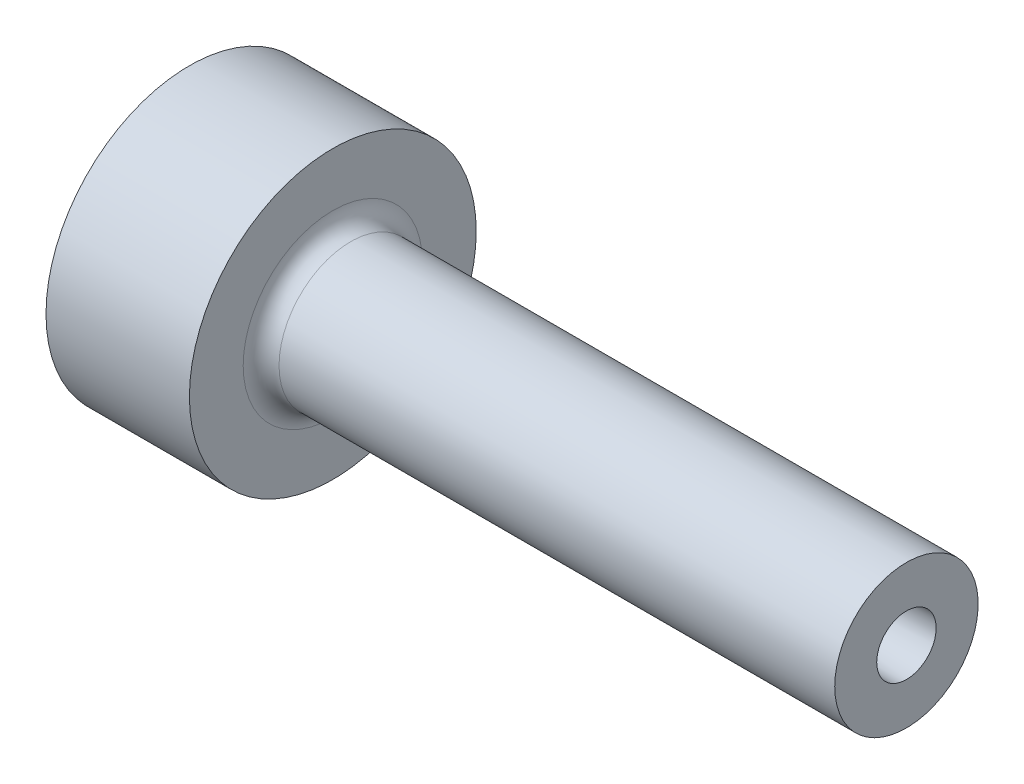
ISO-10303-21;
HEADER;
FILE_DESCRIPTION(('STEP AP214'),'2;1');
FILE_NAME('part.step','',(''),(''),'','','');
FILE_SCHEMA(('AUTOMOTIVE_DESIGN { 1 0 10303 214 1 1 1 1 }'));
ENDSEC;
DATA;
#1=APPLICATION_CONTEXT('core data for automotive mechanical design processes');
#2=APPLICATION_PROTOCOL_DEFINITION('international standard','automotive_design',2000,#1);
#3=PRODUCT_CONTEXT('',#1,'mechanical');
#4=PRODUCT('Part','Part','',(#3));
#5=PRODUCT_RELATED_PRODUCT_CATEGORY('part','',(#4));
#6=PRODUCT_DEFINITION_FORMATION('','',#4);
#7=PRODUCT_DEFINITION_CONTEXT('part definition',#1,'design');
#8=PRODUCT_DEFINITION('design','',#6,#7);
#9=PRODUCT_DEFINITION_SHAPE('','',#8);
#10=(LENGTH_UNIT() NAMED_UNIT(*) SI_UNIT(.MILLI.,.METRE.));
#11=(NAMED_UNIT(*) PLANE_ANGLE_UNIT() SI_UNIT($,.RADIAN.));
#12=(NAMED_UNIT(*) SI_UNIT($,.STERADIAN.) SOLID_ANGLE_UNIT());
#13=UNCERTAINTY_MEASURE_WITH_UNIT(LENGTH_MEASURE(1.E-05),#10,'distance_accuracy_value','');
#14=(GEOMETRIC_REPRESENTATION_CONTEXT(3) GLOBAL_UNCERTAINTY_ASSIGNED_CONTEXT((#13)) GLOBAL_UNIT_ASSIGNED_CONTEXT((#10,
#11,#12)) REPRESENTATION_CONTEXT('',''));
#15=CARTESIAN_POINT('',(0.,0.,0.));
#16=DIRECTION('',(0.,0.,1.));
#17=DIRECTION('',(1.,0.,0.));
#18=AXIS2_PLACEMENT_3D('',#15,#16,#17);
#19=CARTESIAN_POINT('',(0.,0.,0.));
#20=DIRECTION('',(-1.,0.,0.));
#21=DIRECTION('',(0.,0.,1.));
#22=AXIS2_PLACEMENT_3D('',#19,#20,#21);
#23=CYLINDRICAL_SURFACE('',#22,24.);
#24=CARTESIAN_POINT('',(24.,0.,0.));
#25=DIRECTION('',(-1.,0.,0.));
#26=DIRECTION('',(0.,0.,1.));
#27=AXIS2_PLACEMENT_3D('',#24,#25,#26);
#28=CIRCLE('',#27,24.);
#29=CARTESIAN_POINT('',(24.,0.,24.));
#30=VERTEX_POINT('',#29);
#31=EDGE_CURVE('E90',#30,#30,#28,.T.);
#32=ORIENTED_EDGE('',*,*,#31,.T.);
#33=EDGE_LOOP('',(#32));
#34=FACE_BOUND('',#33,.T.);
#35=CARTESIAN_POINT('',(0.,0.,0.));
#36=DIRECTION('',(-1.,0.,0.));
#37=DIRECTION('',(0.,0.,1.));
#38=AXIS2_PLACEMENT_3D('',#35,#36,#37);
#39=CIRCLE('',#38,24.);
#40=CARTESIAN_POINT('',(0.,0.,24.));
#41=VERTEX_POINT('',#40);
#42=EDGE_CURVE('E84',#41,#41,#39,.T.);
#43=ORIENTED_EDGE('',*,*,#42,.F.);
#44=EDGE_LOOP('',(#43));
#45=FACE_BOUND('',#44,.T.);
#46=CARTESIAN_POINT('',(12.,-23.9165214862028,-2.));
#47=CARTESIAN_POINT('',(12.1121314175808,-23.9165225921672,-1.99999510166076));
#48=CARTESIAN_POINT('',(12.2243391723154,-23.9173185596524,-1.99053818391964));
#49=CARTESIAN_POINT('',(12.4456500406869,-23.9204163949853,-1.95295195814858));
#50=CARTESIAN_POINT('',(12.5547494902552,-23.9227199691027,-1.92480149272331));
#51=CARTESIAN_POINT('',(12.7666063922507,-23.9285703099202,-1.85064796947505));
#52=CARTESIAN_POINT('',(12.8693674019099,-23.9321163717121,-1.80465503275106));
#53=CARTESIAN_POINT('',(13.0656863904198,-23.9400512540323,-1.69614013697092));
#54=CARTESIAN_POINT('',(13.1592463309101,-23.944439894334,-1.63362171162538));
#55=CARTESIAN_POINT('',(13.3347720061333,-23.9535780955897,-1.49365707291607));
#56=CARTESIAN_POINT('',(13.4167108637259,-23.9583284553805,-1.41617720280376));
#57=CARTESIAN_POINT('',(13.566437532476,-23.9676475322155,-1.24856024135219));
#58=CARTESIAN_POINT('',(13.6342247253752,-23.9722162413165,-1.15842259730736));
#59=CARTESIAN_POINT('',(13.7538132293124,-23.9806648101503,-0.967888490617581));
#60=CARTESIAN_POINT('',(13.8055912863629,-23.9845436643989,-0.867477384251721));
#61=CARTESIAN_POINT('',(13.891542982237,-23.9911668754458,-0.659348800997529));
#62=CARTESIAN_POINT('',(13.9257169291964,-23.9939112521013,-0.551631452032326));
#63=CARTESIAN_POINT('',(13.9754129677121,-23.9979507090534,-0.332215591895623));
#64=CARTESIAN_POINT('',(13.9909785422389,-23.999249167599,-0.220526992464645));
#65=CARTESIAN_POINT('',(14.0031504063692,-24.0002619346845,0.00388456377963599));
#66=CARTESIAN_POINT('',(13.9997570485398,-23.9999762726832,0.116607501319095));
#67=CARTESIAN_POINT('',(13.9741429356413,-23.9978557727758,0.339593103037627));
#68=CARTESIAN_POINT('',(13.9519689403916,-23.9960247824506,0.449861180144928));
#69=CARTESIAN_POINT('',(13.8894956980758,-23.9910239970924,0.665104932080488));
#70=CARTESIAN_POINT('',(13.8491962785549,-23.9878541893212,0.770080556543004));
#71=CARTESIAN_POINT('',(13.7515640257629,-23.9805257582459,0.971908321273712));
#72=CARTESIAN_POINT('',(13.6942102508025,-23.9763659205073,1.06875028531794));
#73=CARTESIAN_POINT('',(13.5641125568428,-23.967524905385,1.25145067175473));
#74=CARTESIAN_POINT('',(13.4913683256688,-23.9628437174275,1.33730887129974));
#75=CARTESIAN_POINT('',(13.3322911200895,-23.9534692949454,1.49587792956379));
#76=CARTESIAN_POINT('',(13.2459175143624,-23.9487760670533,1.56854803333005));
#77=CARTESIAN_POINT('',(13.0621749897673,-23.9399208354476,1.69836319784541));
#78=CARTESIAN_POINT('',(12.9648060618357,-23.9357588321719,1.75550824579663));
#79=CARTESIAN_POINT('',(12.7618082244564,-23.9284365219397,1.85264960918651));
#80=CARTESIAN_POINT('',(12.6561782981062,-23.9252763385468,1.8926438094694));
#81=CARTESIAN_POINT('',(12.439670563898,-23.9203178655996,1.95431801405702));
#82=CARTESIAN_POINT('',(12.3287928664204,-23.9185195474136,1.9759984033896));
#83=CARTESIAN_POINT('',(12.1052936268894,-23.9164930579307,2.00037796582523));
#84=CARTESIAN_POINT('',(11.9926783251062,-23.9162601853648,2.00313397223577));
#85=CARTESIAN_POINT('',(11.7685873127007,-23.9173785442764,1.98973541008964));
#86=CARTESIAN_POINT('',(11.6571115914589,-23.9187297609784,1.97358101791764));
#87=CARTESIAN_POINT('',(11.4386272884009,-23.922859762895,1.92286760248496));
#88=CARTESIAN_POINT('',(11.3316125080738,-23.9256364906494,1.8883351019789));
#89=CARTESIAN_POINT('',(11.1248958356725,-23.9323029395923,1.80187268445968));
#90=CARTESIAN_POINT('',(11.0251940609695,-23.9361926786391,1.74994248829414));
#91=CARTESIAN_POINT('',(10.8356734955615,-23.9446582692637,1.6300149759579));
#92=CARTESIAN_POINT('',(10.7458787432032,-23.9492357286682,1.56197978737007));
#93=CARTESIAN_POINT('',(10.5789641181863,-23.9585555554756,1.41182825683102));
#94=CARTESIAN_POINT('',(10.5018444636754,-23.9632979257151,1.32971167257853));
#95=CARTESIAN_POINT('',(10.3622751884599,-23.9724272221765,1.15348274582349));
#96=CARTESIAN_POINT('',(10.2998624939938,-23.9768132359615,1.05934110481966));
#97=CARTESIAN_POINT('',(10.1917321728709,-23.9847224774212,0.861880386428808));
#98=CARTESIAN_POINT('',(10.1460143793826,-23.9882457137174,0.758561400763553));
#99=CARTESIAN_POINT('',(10.0726350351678,-23.994028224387,0.545811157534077));
#100=CARTESIAN_POINT('',(10.0449506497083,-23.9962890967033,0.436387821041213));
#101=CARTESIAN_POINT('',(10.0083493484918,-23.9992986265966,0.214426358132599));
#102=CARTESIAN_POINT('',(9.99943207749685,-24.0000473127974,0.101888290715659));
#103=CARTESIAN_POINT('',(10.000622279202,-23.9999481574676,-0.122744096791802));
#104=CARTESIAN_POINT('',(10.0106722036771,-23.9991051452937,-0.234838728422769));
#105=CARTESIAN_POINT('',(10.0493915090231,-23.9959268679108,-0.455742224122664));
#106=CARTESIAN_POINT('',(10.0780609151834,-23.993591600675,-0.564551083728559));
#107=CARTESIAN_POINT('',(10.1531907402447,-23.9876908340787,-0.775798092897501));
#108=CARTESIAN_POINT('',(10.1996501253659,-23.9841254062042,-0.878236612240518));
#109=CARTESIAN_POINT('',(10.3090344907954,-23.9761631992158,-1.07386914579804));
#110=CARTESIAN_POINT('',(10.3719592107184,-23.9717664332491,-1.16706330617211));
#111=CARTESIAN_POINT('',(10.5127040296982,-23.9626191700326,-1.34185617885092));
#112=CARTESIAN_POINT('',(10.5905667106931,-23.9578676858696,-1.42342055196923));
#113=CARTESIAN_POINT('',(10.7589003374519,-23.9485548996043,-1.57235565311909));
#114=CARTESIAN_POINT('',(10.8493743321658,-23.9439936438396,-1.63972293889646));
#115=CARTESIAN_POINT('',(11.0405380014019,-23.9355684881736,-1.75844275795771));
#116=CARTESIAN_POINT('',(11.1412465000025,-23.9317059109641,-1.80976504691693));
#117=CARTESIAN_POINT('',(11.3498148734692,-23.9251315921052,-1.89470580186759));
#118=CARTESIAN_POINT('',(11.4576663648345,-23.922418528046,-1.92834462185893));
#119=CARTESIAN_POINT('',(11.6384617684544,-23.9191481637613,-1.96839619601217));
#120=CARTESIAN_POINT('',(11.7102429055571,-23.9181676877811,-1.98023186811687));
#121=CARTESIAN_POINT('',(11.8546720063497,-23.916853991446,-1.99603534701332));
#122=CARTESIAN_POINT('',(11.9273199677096,-23.9165207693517,-2.0000031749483));
#123=CARTESIAN_POINT('',(12.,-23.9165214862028,-2.));
#124=B_SPLINE_CURVE_WITH_KNOTS('',3,(#46,#47,#48,#49,#50,#51,#52,#53,#54,#55,#56,#57,#58,#59,
#60,#61,#62,#63,#64,#65,#66,#67,#68,#69,#70,#71,#72,#73,#74,#75,#76,#77,#78,#79,#80,#81,#82,#83,
#84,#85,#86,#87,#88,#89,#90,#91,#92,#93,#94,#95,#96,#97,#98,#99,#100,#101,#102,#103,#104,#105,
#106,#107,#108,#109,#110,#111,#112,#113,#114,#115,#116,#117,#118,#119,#120,#121,#122,#123),
.UNSPECIFIED.,.T.,.F.,(4,2,2,2,2,2,2,2,2,2,2,2,2,2,2,2,2,2,2,2,2,2,2,2,2,2,2,2,2,2,2,2,2,2,2,2,
2,2,4),(0.,0.336128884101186,0.672638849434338,1.00895820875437,1.34520570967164,
1.68221862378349,2.01924625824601,2.35676116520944,2.69427016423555,3.03098894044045,
3.36770145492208,3.70357808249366,4.0394579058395,4.37575188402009,4.71205268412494,
5.04937568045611,5.38669895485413,5.72406381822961,6.06142158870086,6.39776576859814,
6.73410681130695,7.06996376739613,7.4058261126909,7.7424862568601,8.07915219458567,
8.41665463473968,8.75415370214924,9.09122457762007,9.42828907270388,9.76433252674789,
10.100376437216,10.4364008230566,10.7724198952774,11.1094114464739,11.4464846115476,
11.7841893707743,12.1215045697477,12.339373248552,12.5572413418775),.UNSPECIFIED.);
#125=CARTESIAN_POINT('',(12.,-23.9165214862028,-2.));
#126=VERTEX_POINT('',#125);
#127=EDGE_CURVE('E10',#126,#126,#124,.T.);
#128=ORIENTED_EDGE('',*,*,#127,.F.);
#129=EDGE_LOOP('',(#128));
#130=FACE_BOUND('',#129,.T.);
#131=ADVANCED_FACE('F16',(#34,#45,#130),#23,.T.);
#132=CARTESIAN_POINT('',(0.,0.,0.));
#133=DIRECTION('',(1.,0.,0.));
#134=DIRECTION('',(0.,0.,-1.));
#135=AXIS2_PLACEMENT_3D('',#132,#133,#134);
#136=CONICAL_SURFACE('',#135,2.25,0.0226892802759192);
#137=CARTESIAN_POINT('',(120.,0.,0.));
#138=DIRECTION('',(-1.,0.,0.));
#139=DIRECTION('',(0.,0.,1.));
#140=AXIS2_PLACEMENT_3D('',#137,#138,#139);
#141=CIRCLE('',#140,4.97318095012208);
#142=CARTESIAN_POINT('',(120.,0.,4.97318095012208));
#143=VERTEX_POINT('',#142);
#144=EDGE_CURVE('E77',#143,#143,#141,.T.);
#145=ORIENTED_EDGE('',*,*,#144,.F.);
#146=EDGE_LOOP('',(#145));
#147=FACE_BOUND('',#146,.T.);
#148=CARTESIAN_POINT('',(4.12419682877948,0.,0.));
#149=DIRECTION('',(-1.,0.,0.));
#150=DIRECTION('',(0.,0.,1.));
#151=AXIS2_PLACEMENT_3D('',#148,#149,#150);
#152=CIRCLE('',#151,2.34359111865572);
#153=CARTESIAN_POINT('',(4.12419682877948,0.,2.34359111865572));
#154=VERTEX_POINT('',#153);
#155=EDGE_CURVE('E97',#154,#154,#152,.F.);
#156=ORIENTED_EDGE('',*,*,#155,.F.);
#157=EDGE_LOOP('',(#156));
#158=FACE_BOUND('',#157,.T.);
#159=ADVANCED_FACE('F44',(#147,#158),#136,.F.);
#160=CARTESIAN_POINT('',(27.,0.,0.));
#161=DIRECTION('',(-1.,0.,0.));
#162=DIRECTION('',(0.,0.,1.));
#163=AXIS2_PLACEMENT_3D('',#160,#161,#162);
#164=TOROIDAL_SURFACE('',#163,15.,3.);
#165=CARTESIAN_POINT('',(24.,0.,0.));
#166=DIRECTION('',(-1.,0.,0.));
#167=DIRECTION('',(0.,0.,1.));
#168=AXIS2_PLACEMENT_3D('',#165,#166,#167);
#169=CIRCLE('',#168,15.);
#170=CARTESIAN_POINT('',(24.,0.,15.));
#171=VERTEX_POINT('',#170);
#172=EDGE_CURVE('E93',#171,#171,#169,.T.);
#173=ORIENTED_EDGE('',*,*,#172,.F.);
#174=EDGE_LOOP('',(#173));
#175=FACE_BOUND('',#174,.T.);
#176=CARTESIAN_POINT('',(27.,0.,0.));
#177=DIRECTION('',(-1.,0.,0.));
#178=DIRECTION('',(0.,0.,1.));
#179=AXIS2_PLACEMENT_3D('',#176,#177,#178);
#180=CIRCLE('',#179,12.);
#181=CARTESIAN_POINT('',(27.,0.,12.));
#182=VERTEX_POINT('',#181);
#183=EDGE_CURVE('E29',#182,#182,#180,.T.);
#184=ORIENTED_EDGE('',*,*,#183,.T.);
#185=EDGE_LOOP('',(#184));
#186=FACE_BOUND('',#185,.T.);
#187=ADVANCED_FACE('F18',(#175,#186),#164,.F.);
#188=CARTESIAN_POINT('',(0.,0.,0.));
#189=DIRECTION('',(-1.,0.,0.));
#190=DIRECTION('',(0.,0.,1.));
#191=AXIS2_PLACEMENT_3D('',#188,#189,#190);
#192=CYLINDRICAL_SURFACE('',#191,12.);
#193=ORIENTED_EDGE('',*,*,#183,.F.);
#194=EDGE_LOOP('',(#193));
#195=FACE_BOUND('',#194,.T.);
#196=CARTESIAN_POINT('',(120.,0.,0.));
#197=DIRECTION('',(-1.,0.,0.));
#198=DIRECTION('',(0.,0.,1.));
#199=AXIS2_PLACEMENT_3D('',#196,#197,#198);
#200=CIRCLE('',#199,12.);
#201=CARTESIAN_POINT('',(120.,0.,12.));
#202=VERTEX_POINT('',#201);
#203=EDGE_CURVE('E75',#202,#202,#200,.T.);
#204=ORIENTED_EDGE('',*,*,#203,.T.);
#205=EDGE_LOOP('',(#204));
#206=FACE_BOUND('',#205,.T.);
#207=ADVANCED_FACE('F63',(#195,#206),#192,.T.);
#208=CARTESIAN_POINT('',(120.,12.,0.));
#209=DIRECTION('',(-1.,0.,0.));
#210=DIRECTION('',(0.,0.,1.));
#211=AXIS2_PLACEMENT_3D('',#208,#209,#210);
#212=PLANE('',#211);
#213=ORIENTED_EDGE('',*,*,#203,.F.);
#214=EDGE_LOOP('',(#213));
#215=FACE_BOUND('',#214,.T.);
#216=ORIENTED_EDGE('',*,*,#144,.T.);
#217=EDGE_LOOP('',(#216));
#218=FACE_BOUND('',#217,.T.);
#219=ADVANCED_FACE('F59',(#215,#218),#212,.F.);
#220=CARTESIAN_POINT('',(0.,2.25,0.));
#221=DIRECTION('',(1.,0.,0.));
#222=DIRECTION('',(0.,0.,-1.));
#223=AXIS2_PLACEMENT_3D('',#220,#221,#222);
#224=PLANE('',#223);
#225=CARTESIAN_POINT('',(0.,0.,0.));
#226=DIRECTION('',(-1.,0.,0.));
#227=DIRECTION('',(0.,0.,1.));
#228=AXIS2_PLACEMENT_3D('',#225,#226,#227);
#229=CIRCLE('',#228,21.);
#230=CARTESIAN_POINT('',(0.,0.,21.));
#231=VERTEX_POINT('',#230);
#232=EDGE_CURVE('E100',#231,#231,#229,.T.);
#233=ORIENTED_EDGE('',*,*,#232,.F.);
#234=EDGE_LOOP('',(#233));
#235=FACE_BOUND('',#234,.T.);
#236=ORIENTED_EDGE('',*,*,#42,.T.);
#237=EDGE_LOOP('',(#236));
#238=FACE_BOUND('',#237,.T.);
#239=ADVANCED_FACE('F57',(#235,#238),#224,.F.);
#240=CARTESIAN_POINT('',(24.,24.,0.));
#241=DIRECTION('',(-1.,0.,0.));
#242=DIRECTION('',(0.,0.,1.));
#243=AXIS2_PLACEMENT_3D('',#240,#241,#242);
#244=PLANE('',#243);
#245=ORIENTED_EDGE('',*,*,#31,.F.);
#246=EDGE_LOOP('',(#245));
#247=FACE_BOUND('',#246,.T.);
#248=ORIENTED_EDGE('',*,*,#172,.T.);
#249=EDGE_LOOP('',(#248));
#250=FACE_BOUND('',#249,.T.);
#251=ADVANCED_FACE('F55',(#247,#250),#244,.F.);
#252=CARTESIAN_POINT('',(-35.8646602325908,0.,0.));
#253=DIRECTION('',(-1.,0.,0.));
#254=DIRECTION('',(0.,0.,1.));
#255=AXIS2_PLACEMENT_3D('',#252,#253,#254);
#256=DEGENERATE_TOROIDAL_SURFACE('',#255,3.28768376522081,40.,.T.);
#257=ORIENTED_EDGE('',*,*,#232,.T.);
#258=EDGE_LOOP('',(#257));
#259=FACE_BOUND('',#258,.T.);
#260=ORIENTED_EDGE('',*,*,#155,.T.);
#261=EDGE_LOOP('',(#260));
#262=FACE_BOUND('',#261,.T.);
#263=ADVANCED_FACE('F40',(#259,#262),#256,.F.);
#264=CARTESIAN_POINT('',(12.,-24.,0.));
#265=DIRECTION('',(0.,-1.,0.));
#266=DIRECTION('',(0.,0.,-1.));
#267=AXIS2_PLACEMENT_3D('',#264,#265,#266);
#268=CYLINDRICAL_SURFACE('',#267,2.);
#269=CARTESIAN_POINT('',(12.,-18.,0.));
#270=DIRECTION('',(0.,-1.,0.));
#271=DIRECTION('',(0.,0.,-1.));
#272=AXIS2_PLACEMENT_3D('',#269,#270,#271);
#273=CIRCLE('',#272,2.);
#274=CARTESIAN_POINT('',(12.,-18.,-2.));
#275=VERTEX_POINT('',#274);
#276=EDGE_CURVE('E104',#275,#275,#273,.T.);
#277=ORIENTED_EDGE('',*,*,#276,.F.);
#278=EDGE_LOOP('',(#277));
#279=FACE_BOUND('',#278,.T.);
#280=ORIENTED_EDGE('',*,*,#127,.T.);
#281=EDGE_LOOP('',(#280));
#282=FACE_BOUND('',#281,.T.);
#283=ADVANCED_FACE('F34',(#279,#282),#268,.F.);
#284=CARTESIAN_POINT('',(12.,-16.8452994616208,0.));
#285=DIRECTION('',(0.,-1.,0.));
#286=DIRECTION('',(0.,0.,-1.));
#287=AXIS2_PLACEMENT_3D('',#284,#285,#286);
#288=CONICAL_SURFACE('',#287,0.,1.0471975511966);
#289=ORIENTED_EDGE('',*,*,#276,.T.);
#290=EDGE_LOOP('',(#289));
#291=FACE_BOUND('',#290,.T.);
#292=CARTESIAN_POINT('',(12.,-16.8452994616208,0.));
#293=VERTEX_POINT('',#292);
#294=VERTEX_LOOP('',#293);
#295=FACE_BOUND('',#294,.T.);
#296=ADVANCED_FACE('F32',(#291,#295),#288,.F.);
#297=CLOSED_SHELL('',(#131,#159,#187,#207,#219,#239,#251,#263,#283,#296));
#298=MANIFOLD_SOLID_BREP('B1',#297);
#299=ADVANCED_BREP_SHAPE_REPRESENTATION('',(#18,#298),#14);
#300=SHAPE_DEFINITION_REPRESENTATION(#9,#299);
ENDSEC;
END-ISO-10303-21;
